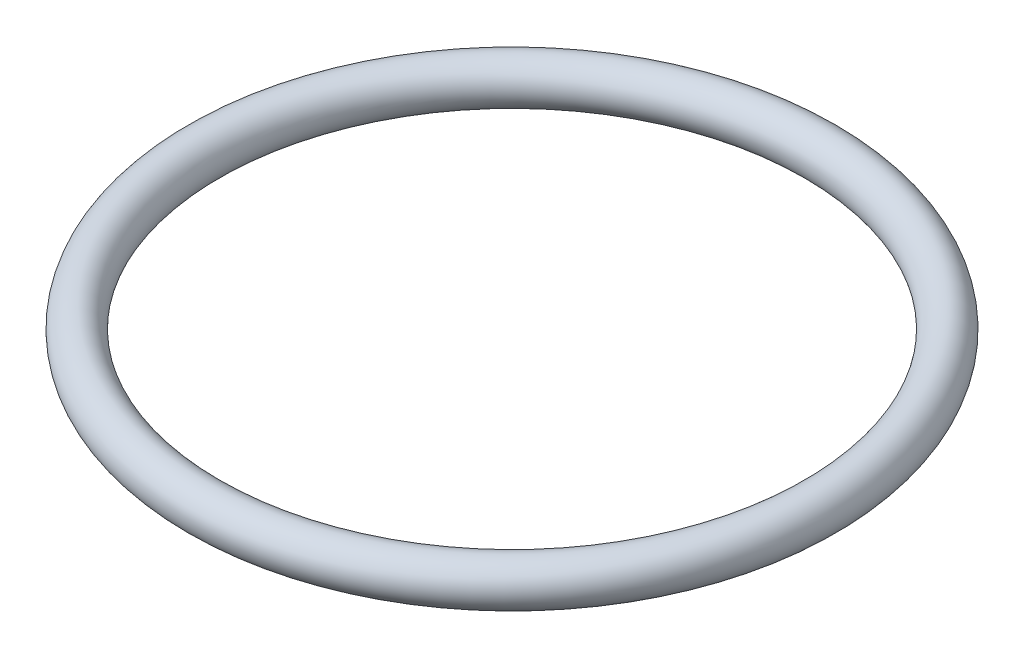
ISO-10303-21;
HEADER;
FILE_DESCRIPTION(('STEP AP214'),'2;1');
FILE_NAME('part.step','',(''),(''),'','','');
FILE_SCHEMA(('AUTOMOTIVE_DESIGN { 1 0 10303 214 1 1 1 1 }'));
ENDSEC;
DATA;
#1=APPLICATION_CONTEXT('core data for automotive mechanical design processes');
#2=APPLICATION_PROTOCOL_DEFINITION('international standard','automotive_design',2000,#1);
#3=PRODUCT_CONTEXT('',#1,'mechanical');
#4=PRODUCT('Part','Part','',(#3));
#5=PRODUCT_RELATED_PRODUCT_CATEGORY('part','',(#4));
#6=PRODUCT_DEFINITION_FORMATION('','',#4);
#7=PRODUCT_DEFINITION_CONTEXT('part definition',#1,'design');
#8=PRODUCT_DEFINITION('design','',#6,#7);
#9=PRODUCT_DEFINITION_SHAPE('','',#8);
#10=(LENGTH_UNIT() NAMED_UNIT(*) SI_UNIT(.MILLI.,.METRE.));
#11=(NAMED_UNIT(*) PLANE_ANGLE_UNIT() SI_UNIT($,.RADIAN.));
#12=(NAMED_UNIT(*) SI_UNIT($,.STERADIAN.) SOLID_ANGLE_UNIT());
#13=UNCERTAINTY_MEASURE_WITH_UNIT(LENGTH_MEASURE(1.E-05),#10,'distance_accuracy_value','');
#14=(GEOMETRIC_REPRESENTATION_CONTEXT(3) GLOBAL_UNCERTAINTY_ASSIGNED_CONTEXT((#13)) GLOBAL_UNIT_ASSIGNED_CONTEXT((#10,
#11,#12)) REPRESENTATION_CONTEXT('',''));
#15=CARTESIAN_POINT('',(0.,0.,0.));
#16=DIRECTION('',(0.,0.,1.));
#17=DIRECTION('',(1.,0.,0.));
#18=AXIS2_PLACEMENT_3D('',#15,#16,#17);
#19=CARTESIAN_POINT('',(0.,0.,0.));
#20=DIRECTION('',(0.,1.,0.));
#21=DIRECTION('',(0.,0.,1.));
#22=AXIS2_PLACEMENT_3D('',#19,#20,#21);
#23=TOROIDAL_SURFACE('',#22,40.35,2.85);
#24=CARTESIAN_POINT('',(0.,0.,43.2));
#25=VERTEX_POINT('',#24);
#26=VERTEX_LOOP('',#25);
#27=FACE_BOUND('',#26,.T.);
#28=ADVANCED_FACE('F29',(#27),#23,.T.);
#29=CLOSED_SHELL('',(#28));
#30=MANIFOLD_SOLID_BREP('B2',#29);
#31=ADVANCED_BREP_SHAPE_REPRESENTATION('',(#18,#30),#14);
#32=SHAPE_DEFINITION_REPRESENTATION(#9,#31);
ENDSEC;
END-ISO-10303-21;
